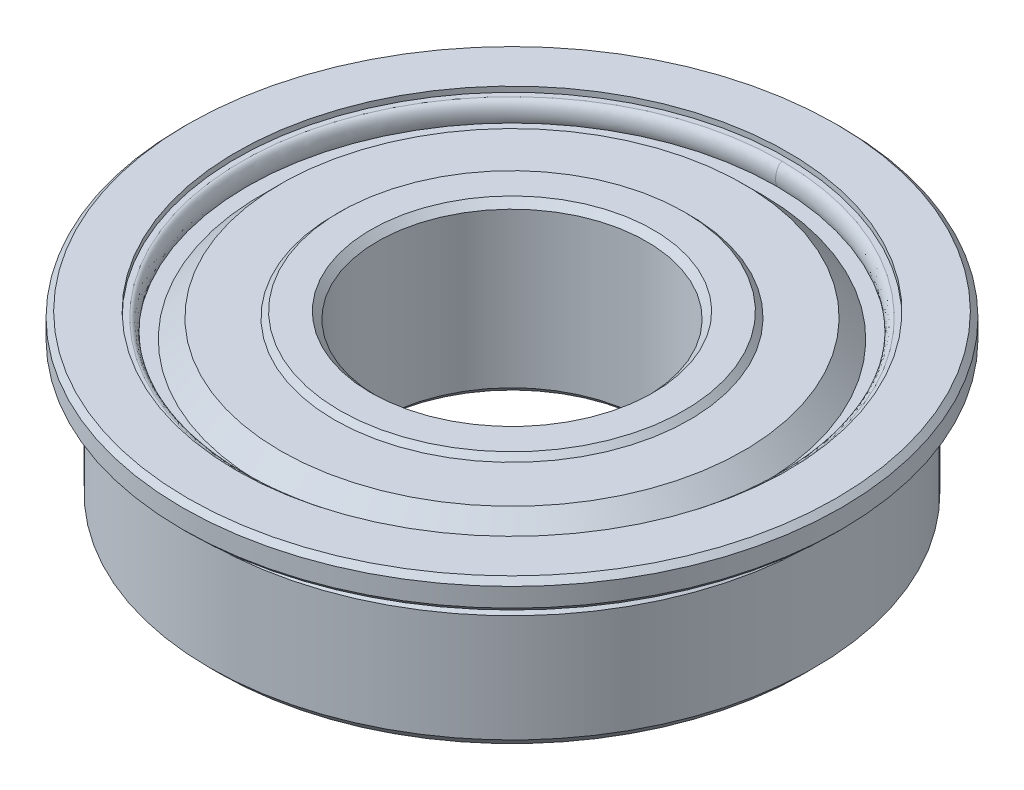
ISO-10303-21;
HEADER;
FILE_DESCRIPTION(('STEP AP214'),'2;1');
FILE_NAME('part.step','',(''),(''),'','','');
FILE_SCHEMA(('AUTOMOTIVE_DESIGN { 1 0 10303 214 1 1 1 1 }'));
ENDSEC;
DATA;
#1=APPLICATION_CONTEXT('core data for automotive mechanical design processes');
#2=APPLICATION_PROTOCOL_DEFINITION('international standard','automotive_design',2000,#1);
#3=PRODUCT_CONTEXT('',#1,'mechanical');
#4=PRODUCT('Part','Part','',(#3));
#5=PRODUCT_RELATED_PRODUCT_CATEGORY('part','',(#4));
#6=PRODUCT_DEFINITION_FORMATION('','',#4);
#7=PRODUCT_DEFINITION_CONTEXT('part definition',#1,'design');
#8=PRODUCT_DEFINITION('design','',#6,#7);
#9=PRODUCT_DEFINITION_SHAPE('','',#8);
#10=(LENGTH_UNIT() NAMED_UNIT(*) SI_UNIT(.MILLI.,.METRE.));
#11=(NAMED_UNIT(*) PLANE_ANGLE_UNIT() SI_UNIT($,.RADIAN.));
#12=(NAMED_UNIT(*) SI_UNIT($,.STERADIAN.) SOLID_ANGLE_UNIT());
#13=UNCERTAINTY_MEASURE_WITH_UNIT(LENGTH_MEASURE(1.E-05),#10,'distance_accuracy_value','');
#14=(GEOMETRIC_REPRESENTATION_CONTEXT(3) GLOBAL_UNCERTAINTY_ASSIGNED_CONTEXT((#13)) GLOBAL_UNIT_ASSIGNED_CONTEXT((#10,
#11,#12)) REPRESENTATION_CONTEXT('',''));
#15=CARTESIAN_POINT('',(0.,0.,0.));
#16=DIRECTION('',(0.,0.,1.));
#17=DIRECTION('',(1.,0.,0.));
#18=AXIS2_PLACEMENT_3D('',#15,#16,#17);
#19=CARTESIAN_POINT('',(0.,-0.254,-12.7635));
#20=CARTESIAN_POINT('',(-25.527,-0.253999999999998,-12.7635));
#21=CARTESIAN_POINT('',(-25.527,-0.254000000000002,12.7635));
#22=CARTESIAN_POINT('',(0.,-0.254,12.7635));
#23=CARTESIAN_POINT('',(0.,-0.254,-12.7168318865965));
#24=CARTESIAN_POINT('',(-25.433663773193,-0.253999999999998,-12.7168318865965));
#25=CARTESIAN_POINT('',(-25.433663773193,-0.254000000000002,12.7168318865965));
#26=CARTESIAN_POINT('',(0.,-0.254,12.7168318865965));
#27=CARTESIAN_POINT('',(0.,-0.291495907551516,-12.6089230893));
#28=CARTESIAN_POINT('',(-25.2178461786,-0.291495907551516,-12.6089230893));
#29=CARTESIAN_POINT('',(-25.2178461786,-0.291495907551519,12.6089230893));
#30=CARTESIAN_POINT('',(0.,-0.291495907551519,12.6089230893));
#31=CARTESIAN_POINT('',(0.,-0.538559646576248,-12.4652687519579));
#32=CARTESIAN_POINT('',(-24.9305375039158,-0.538559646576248,-12.4652687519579));
#33=CARTESIAN_POINT('',(-24.9305375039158,-0.538559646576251,12.4652687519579));
#34=CARTESIAN_POINT('',(0.,-0.538559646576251,12.4652687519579));
#35=CARTESIAN_POINT('',(0.,-0.890819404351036,-12.4309498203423));
#36=CARTESIAN_POINT('',(-24.8618996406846,-0.890819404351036,-12.4309498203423));
#37=CARTESIAN_POINT('',(-24.8618996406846,-0.890819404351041,12.4309498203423));
#38=CARTESIAN_POINT('',(0.,-0.890819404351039,12.4309498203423));
#39=CARTESIAN_POINT('',(0.,-1.07315356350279,-12.473578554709));
#40=CARTESIAN_POINT('',(-24.947157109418,-1.07315356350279,-12.473578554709));
#41=CARTESIAN_POINT('',(-24.947157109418,-1.0731535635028,12.473578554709));
#42=CARTESIAN_POINT('',(0.,-1.0731535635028,12.473578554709));
#43=CARTESIAN_POINT('',(0.,-1.143,-12.4995052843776));
#44=CARTESIAN_POINT('',(-24.9990105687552,-1.143,-12.4995052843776));
#45=CARTESIAN_POINT('',(-24.9990105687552,-1.143,12.4995052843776));
#46=CARTESIAN_POINT('',(0.,-1.143,12.4995052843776));
#47=(BOUNDED_SURFACE() B_SPLINE_SURFACE(3,3,((#19,#20,#21,#22),(#23,#24,#25,#26),(#27,#28,#29,
#30),(#31,#32,#33,#34),(#35,#36,#37,#38),(#39,#40,#41,#42),(#43,#44,#45,#46)),.UNSPECIFIED.,.F.,
.F.,.F.) B_SPLINE_SURFACE_WITH_KNOTS((4,1,1,1,4),(4,4),(0.,0.25,0.5,0.75,1.),(0.,1.),
.UNSPECIFIED.) GEOMETRIC_REPRESENTATION_ITEM() RATIONAL_B_SPLINE_SURFACE(((1.,0.333333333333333,
0.333333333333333,1.),(1.,0.333333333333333,0.333333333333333,1.),(1.,0.333333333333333,
0.333333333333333,1.),(1.,0.333333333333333,0.333333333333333,1.),(1.,0.333333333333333,
0.333333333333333,1.),(1.,0.333333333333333,0.333333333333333,1.),(1.,0.333333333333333,
0.333333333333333,1.))) REPRESENTATION_ITEM('') SURFACE());
#48=CARTESIAN_POINT('',(0.,-0.254,0.));
#49=DIRECTION('',(0.,1.,0.));
#50=DIRECTION('',(0.,0.,1.));
#51=AXIS2_PLACEMENT_3D('',#48,#49,#50);
#52=CIRCLE('',#51,12.7635);
#53=CARTESIAN_POINT('',(0.,-0.254,-12.7635));
#54=VERTEX_POINT('',#53);
#55=CARTESIAN_POINT('',(0.,-0.254,12.7635));
#56=VERTEX_POINT('',#55);
#57=EDGE_CURVE('E367',#54,#56,#52,.T.);
#58=CARTESIAN_POINT('',(0.,-0.254,12.7635));
#59=CARTESIAN_POINT('',(0.,-0.254,12.7168318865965));
#60=CARTESIAN_POINT('',(0.,-0.291495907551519,12.6089230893));
#61=CARTESIAN_POINT('',(0.,-0.538559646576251,12.4652687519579));
#62=CARTESIAN_POINT('',(0.,-0.890819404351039,12.4309498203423));
#63=CARTESIAN_POINT('',(0.,-1.0731535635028,12.473578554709));
#64=CARTESIAN_POINT('',(0.,-1.143,12.4995052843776));
#65=(BOUNDED_CURVE() B_SPLINE_CURVE(3,(#58,#59,#60,#61,#62,#63,#64),.UNSPECIFIED.,.F.,
.F.) B_SPLINE_CURVE_WITH_KNOTS((4,1,1,1,4),(0.,0.25,0.5,0.75,1.),
.UNSPECIFIED.) CURVE() GEOMETRIC_REPRESENTATION_ITEM() RATIONAL_B_SPLINE_CURVE((1.,1.,1.,1.,1.,
1.,1.)) REPRESENTATION_ITEM(''));
#66=CARTESIAN_POINT('',(0.,-1.143,12.4995052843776));
#67=VERTEX_POINT('',#66);
#68=EDGE_CURVE('E360',#56,#67,#65,.T.);
#69=CARTESIAN_POINT('',(0.,-1.143,0.));
#70=DIRECTION('',(0.,1.,0.));
#71=DIRECTION('',(0.,0.,1.));
#72=AXIS2_PLACEMENT_3D('',#69,#70,#71);
#73=CIRCLE('',#72,12.4995052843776);
#74=CARTESIAN_POINT('',(0.,-1.143,-12.4995052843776));
#75=VERTEX_POINT('',#74);
#76=EDGE_CURVE('E732',#75,#67,#73,.T.);
#77=CARTESIAN_POINT('',(0.,-0.254,-12.7635));
#78=CARTESIAN_POINT('',(0.,-0.254,-12.7168318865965));
#79=CARTESIAN_POINT('',(0.,-0.291495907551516,-12.6089230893));
#80=CARTESIAN_POINT('',(0.,-0.538559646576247,-12.4652687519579));
#81=CARTESIAN_POINT('',(0.,-0.890819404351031,-12.4309498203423));
#82=CARTESIAN_POINT('',(0.,-1.07315356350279,-12.473578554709));
#83=CARTESIAN_POINT('',(0.,-1.143,-12.4995052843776));
#84=(BOUNDED_CURVE() B_SPLINE_CURVE(3,(#77,#78,#79,#80,#81,#82,#83),.UNSPECIFIED.,.F.,
.F.) B_SPLINE_CURVE_WITH_KNOTS((4,1,1,1,4),(0.,0.25,0.5,0.75,1.),
.UNSPECIFIED.) CURVE() GEOMETRIC_REPRESENTATION_ITEM() RATIONAL_B_SPLINE_CURVE((1.,1.,1.,1.,1.,
1.,1.)) REPRESENTATION_ITEM(''));
#85=EDGE_CURVE('E151',#54,#75,#84,.T.);
#86=ORIENTED_EDGE('',*,*,#57,.T.);
#87=ORIENTED_EDGE('',*,*,#68,.T.);
#88=ORIENTED_EDGE('',*,*,#76,.F.);
#89=ORIENTED_EDGE('',*,*,#85,.F.);
#90=EDGE_LOOP('',(#86,#87,#88,#89));
#91=FACE_BOUND('',#90,.T.);
#92=ADVANCED_FACE('F17',(#91),#47,.F.);
#93=CARTESIAN_POINT('',(0.,-7.6835,12.7635));
#94=CARTESIAN_POINT('',(25.527,-7.6835,12.7635));
#95=CARTESIAN_POINT('',(25.527,-7.6835,-12.7635));
#96=CARTESIAN_POINT('',(0.,-7.6835,-12.7635));
#97=CARTESIAN_POINT('',(0.,-7.6835,12.7168318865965));
#98=CARTESIAN_POINT('',(25.433663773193,-7.6835,12.7168318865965));
#99=CARTESIAN_POINT('',(25.433663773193,-7.6835,-12.7168318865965));
#100=CARTESIAN_POINT('',(0.,-7.6835,-12.7168318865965));
#101=CARTESIAN_POINT('',(0.,-7.64600409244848,12.6089230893));
#102=CARTESIAN_POINT('',(25.2178461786,-7.64600409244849,12.6089230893));
#103=CARTESIAN_POINT('',(25.2178461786,-7.64600409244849,-12.6089230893));
#104=CARTESIAN_POINT('',(0.,-7.64600409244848,-12.6089230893));
#105=CARTESIAN_POINT('',(0.,-7.39894035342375,12.4652687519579));
#106=CARTESIAN_POINT('',(24.9305375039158,-7.39894035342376,12.4652687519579));
#107=CARTESIAN_POINT('',(24.9305375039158,-7.39894035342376,-12.4652687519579));
#108=CARTESIAN_POINT('',(0.,-7.39894035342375,-12.4652687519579));
#109=CARTESIAN_POINT('',(0.,-7.04668059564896,12.4309498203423));
#110=CARTESIAN_POINT('',(24.8618996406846,-7.04668059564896,12.4309498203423));
#111=CARTESIAN_POINT('',(24.8618996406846,-7.04668059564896,-12.4309498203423));
#112=CARTESIAN_POINT('',(0.,-7.04668059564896,-12.4309498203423));
#113=CARTESIAN_POINT('',(0.,-6.8643464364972,12.473578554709));
#114=CARTESIAN_POINT('',(24.947157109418,-6.86434643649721,12.473578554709));
#115=CARTESIAN_POINT('',(24.947157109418,-6.86434643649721,-12.473578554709));
#116=CARTESIAN_POINT('',(0.,-6.8643464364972,-12.473578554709));
#117=CARTESIAN_POINT('',(0.,-6.7945,12.4995052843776));
#118=CARTESIAN_POINT('',(24.9990105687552,-6.7945,12.4995052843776));
#119=CARTESIAN_POINT('',(24.9990105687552,-6.7945,-12.4995052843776));
#120=CARTESIAN_POINT('',(0.,-6.7945,-12.4995052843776));
#121=(BOUNDED_SURFACE() B_SPLINE_SURFACE(3,3,((#93,#94,#95,#96),(#97,#98,#99,#100),(#101,#102,
#103,#104),(#105,#106,#107,#108),(#109,#110,#111,#112),(#113,#114,#115,#116),(#117,#118,#119,
#120)),.UNSPECIFIED.,.F.,.F.,.F.) B_SPLINE_SURFACE_WITH_KNOTS((4,1,1,1,4),(4,4),(0.,0.25,0.5,
0.75,1.),(0.,1.),.UNSPECIFIED.) GEOMETRIC_REPRESENTATION_ITEM() RATIONAL_B_SPLINE_SURFACE(((1.,
0.333333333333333,0.333333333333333,1.),(1.,0.333333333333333,0.333333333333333,1.),(1.,
0.333333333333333,0.333333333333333,1.),(1.,0.333333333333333,0.333333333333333,1.),(1.,
0.333333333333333,0.333333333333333,1.),(1.,0.333333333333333,0.333333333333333,1.),(1.,
0.333333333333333,0.333333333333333,1.))) REPRESENTATION_ITEM('') SURFACE());
#122=CARTESIAN_POINT('',(0.,-7.6835,0.));
#123=DIRECTION('',(0.,1.,0.));
#124=DIRECTION('',(0.,0.,1.));
#125=AXIS2_PLACEMENT_3D('',#122,#123,#124);
#126=CIRCLE('',#125,12.7635);
#127=CARTESIAN_POINT('',(0.,-7.6835,12.7635));
#128=VERTEX_POINT('',#127);
#129=CARTESIAN_POINT('',(0.,-7.6835,-12.7635));
#130=VERTEX_POINT('',#129);
#131=EDGE_CURVE('E283',#128,#130,#126,.T.);
#132=CARTESIAN_POINT('',(0.,-7.6835,12.7635));
#133=CARTESIAN_POINT('',(0.,-7.6835,12.7168318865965));
#134=CARTESIAN_POINT('',(0.,-7.64600409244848,12.6089230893));
#135=CARTESIAN_POINT('',(0.,-7.39894035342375,12.4652687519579));
#136=CARTESIAN_POINT('',(0.,-7.04668059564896,12.4309498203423));
#137=CARTESIAN_POINT('',(0.,-6.8643464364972,12.473578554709));
#138=CARTESIAN_POINT('',(0.,-6.7945,12.4995052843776));
#139=(BOUNDED_CURVE() B_SPLINE_CURVE(3,(#132,#133,#134,#135,#136,#137,#138),.UNSPECIFIED.,.F.,
.F.) B_SPLINE_CURVE_WITH_KNOTS((4,1,1,1,4),(0.,0.25,0.5,0.75,1.),
.UNSPECIFIED.) CURVE() GEOMETRIC_REPRESENTATION_ITEM() RATIONAL_B_SPLINE_CURVE((0.999999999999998,
0.999999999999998,0.999999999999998,0.999999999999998,0.999999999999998,0.999999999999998,0.999999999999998)) REPRESENTATION_ITEM(''));
#140=CARTESIAN_POINT('',(0.,-6.7945,12.4995052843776));
#141=VERTEX_POINT('',#140);
#142=EDGE_CURVE('E264',#128,#141,#139,.T.);
#143=CARTESIAN_POINT('',(0.,-6.7945,0.));
#144=DIRECTION('',(0.,1.,0.));
#145=DIRECTION('',(0.,0.,1.));
#146=AXIS2_PLACEMENT_3D('',#143,#144,#145);
#147=CIRCLE('',#146,12.4995052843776);
#148=CARTESIAN_POINT('',(0.,-6.7945,-12.4995052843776));
#149=VERTEX_POINT('',#148);
#150=EDGE_CURVE('E271',#141,#149,#147,.T.);
#151=CARTESIAN_POINT('',(0.,-7.6835,-12.7635));
#152=CARTESIAN_POINT('',(0.,-7.6835,-12.7168318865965));
#153=CARTESIAN_POINT('',(0.,-7.64600409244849,-12.6089230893));
#154=CARTESIAN_POINT('',(0.,-7.39894035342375,-12.4652687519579));
#155=CARTESIAN_POINT('',(0.,-7.04668059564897,-12.4309498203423));
#156=CARTESIAN_POINT('',(0.,-6.8643464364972,-12.473578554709));
#157=CARTESIAN_POINT('',(0.,-6.7945,-12.4995052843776));
#158=(BOUNDED_CURVE() B_SPLINE_CURVE(3,(#151,#152,#153,#154,#155,#156,#157),.UNSPECIFIED.,.F.,
.F.) B_SPLINE_CURVE_WITH_KNOTS((4,1,1,1,4),(0.,0.25,0.5,0.75,1.),
.UNSPECIFIED.) CURVE() GEOMETRIC_REPRESENTATION_ITEM() RATIONAL_B_SPLINE_CURVE((0.999999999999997,
0.999999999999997,0.999999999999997,0.999999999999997,0.999999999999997,0.999999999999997,0.999999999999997)) REPRESENTATION_ITEM(''));
#159=EDGE_CURVE('E101',#130,#149,#158,.T.);
#160=ORIENTED_EDGE('',*,*,#131,.F.);
#161=ORIENTED_EDGE('',*,*,#142,.T.);
#162=ORIENTED_EDGE('',*,*,#150,.T.);
#163=ORIENTED_EDGE('',*,*,#159,.F.);
#164=EDGE_LOOP('',(#160,#161,#162,#163));
#165=FACE_BOUND('',#164,.T.);
#166=ADVANCED_FACE('F236',(#165),#121,.T.);
#167=CARTESIAN_POINT('',(0.,-1.524,0.));
#168=DIRECTION('',(0.,-1.,0.));
#169=DIRECTION('',(0.,0.,-1.));
#170=AXIS2_PLACEMENT_3D('',#167,#168,#169);
#171=TOROIDAL_SURFACE('',#170,14.224,0.127);
#172=CARTESIAN_POINT('',(0.,-1.524,0.));
#173=DIRECTION('',(0.,-1.,0.));
#174=DIRECTION('',(0.,0.,-1.));
#175=AXIS2_PLACEMENT_3D('',#172,#173,#174);
#176=CIRCLE('',#175,14.097);
#177=CARTESIAN_POINT('',(0.,-1.524,-14.097));
#178=VERTEX_POINT('',#177);
#179=EDGE_CURVE('E91',#178,#178,#176,.T.);
#180=ORIENTED_EDGE('',*,*,#179,.F.);
#181=EDGE_LOOP('',(#180));
#182=FACE_BOUND('',#181,.T.);
#183=CARTESIAN_POINT('',(0.,-1.397,0.));
#184=DIRECTION('',(0.,1.,0.));
#185=DIRECTION('',(0.,0.,-1.));
#186=AXIS2_PLACEMENT_3D('',#183,#184,#185);
#187=CIRCLE('',#186,14.224);
#188=CARTESIAN_POINT('',(0.,-1.397,-14.224));
#189=VERTEX_POINT('',#188);
#190=EDGE_CURVE('E316',#189,#189,#187,.T.);
#191=ORIENTED_EDGE('',*,*,#190,.F.);
#192=EDGE_LOOP('',(#191));
#193=FACE_BOUND('',#192,.T.);
#194=ADVANCED_FACE('F203',(#182,#193),#171,.F.);
#195=CARTESIAN_POINT('',(0.,-6.7945,0.));
#196=DIRECTION('',(0.,1.,0.));
#197=DIRECTION('',(0.,0.,1.));
#198=AXIS2_PLACEMENT_3D('',#195,#196,#197);
#199=CONICAL_SURFACE('',#198,11.811,0.78539816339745);
#200=CARTESIAN_POINT('',(0.,-7.6835,0.));
#201=DIRECTION('',(0.,1.,0.));
#202=DIRECTION('',(0.,0.,1.));
#203=AXIS2_PLACEMENT_3D('',#200,#201,#202);
#204=CIRCLE('',#203,10.922);
#205=CARTESIAN_POINT('',(0.,-7.6835,10.922));
#206=VERTEX_POINT('',#205);
#207=EDGE_CURVE('E728',#206,#206,#204,.T.);
#208=ORIENTED_EDGE('',*,*,#207,.T.);
#209=EDGE_LOOP('',(#208));
#210=FACE_BOUND('',#209,.T.);
#211=CARTESIAN_POINT('',(0.,-6.7945,0.));
#212=DIRECTION('',(0.,1.,0.));
#213=DIRECTION('',(0.,0.,1.));
#214=AXIS2_PLACEMENT_3D('',#211,#212,#213);
#215=CIRCLE('',#214,11.811);
#216=CARTESIAN_POINT('',(0.,-6.7945,11.811));
#217=VERTEX_POINT('',#216);
#218=EDGE_CURVE('E276',#217,#217,#215,.T.);
#219=ORIENTED_EDGE('',*,*,#218,.F.);
#220=EDGE_LOOP('',(#219));
#221=FACE_BOUND('',#220,.T.);
#222=ADVANCED_FACE('F199',(#210,#221),#199,.T.);
#223=CARTESIAN_POINT('',(0.,-7.6835,0.));
#224=DIRECTION('',(0.,1.,0.));
#225=DIRECTION('',(0.,0.,1.));
#226=AXIS2_PLACEMENT_3D('',#223,#224,#225);
#227=CONICAL_SURFACE('',#226,8.382,0.785398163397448);
#228=CARTESIAN_POINT('',(0.,-7.9375,0.));
#229=DIRECTION('',(0.,1.,0.));
#230=DIRECTION('',(0.,0.,1.));
#231=AXIS2_PLACEMENT_3D('',#228,#229,#230);
#232=CIRCLE('',#231,8.128);
#233=CARTESIAN_POINT('',(0.,-7.9375,8.128));
#234=VERTEX_POINT('',#233);
#235=EDGE_CURVE('E343',#234,#234,#232,.T.);
#236=ORIENTED_EDGE('',*,*,#235,.T.);
#237=EDGE_LOOP('',(#236));
#238=FACE_BOUND('',#237,.T.);
#239=CARTESIAN_POINT('',(0.,-7.6835,0.));
#240=DIRECTION('',(0.,1.,0.));
#241=DIRECTION('',(0.,0.,1.));
#242=AXIS2_PLACEMENT_3D('',#239,#240,#241);
#243=CIRCLE('',#242,8.382);
#244=CARTESIAN_POINT('',(0.,-7.6835,8.382));
#245=VERTEX_POINT('',#244);
#246=EDGE_CURVE('E725',#245,#245,#243,.T.);
#247=ORIENTED_EDGE('',*,*,#246,.F.);
#248=EDGE_LOOP('',(#247));
#249=FACE_BOUND('',#248,.T.);
#250=ADVANCED_FACE('F202',(#238,#249),#227,.T.);
#251=CARTESIAN_POINT('',(0.,-7.9375,0.));
#252=DIRECTION('',(0.,-1.,0.));
#253=DIRECTION('',(0.,0.,-1.));
#254=AXIS2_PLACEMENT_3D('',#251,#252,#253);
#255=CONICAL_SURFACE('',#254,6.6675,0.785398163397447);
#256=CARTESIAN_POINT('',(0.,-7.62,0.));
#257=DIRECTION('',(0.,1.,0.));
#258=DIRECTION('',(0.,0.,1.));
#259=AXIS2_PLACEMENT_3D('',#256,#257,#258);
#260=CIRCLE('',#259,6.35);
#261=CARTESIAN_POINT('',(0.,-7.62,6.35));
#262=VERTEX_POINT('',#261);
#263=EDGE_CURVE('E11',#262,#262,#260,.T.);
#264=ORIENTED_EDGE('',*,*,#263,.T.);
#265=EDGE_LOOP('',(#264));
#266=FACE_BOUND('',#265,.T.);
#267=CARTESIAN_POINT('',(0.,-7.9375,0.));
#268=DIRECTION('',(0.,1.,0.));
#269=DIRECTION('',(0.,0.,1.));
#270=AXIS2_PLACEMENT_3D('',#267,#268,#269);
#271=CIRCLE('',#270,6.6675);
#272=CARTESIAN_POINT('',(0.,-7.9375,6.6675));
#273=VERTEX_POINT('',#272);
#274=EDGE_CURVE('E348',#273,#273,#271,.T.);
#275=ORIENTED_EDGE('',*,*,#274,.F.);
#276=EDGE_LOOP('',(#275));
#277=FACE_BOUND('',#276,.T.);
#278=ADVANCED_FACE('F231',(#266,#277),#255,.F.);
#279=CARTESIAN_POINT('',(0.,0.,0.));
#280=DIRECTION('',(0.,1.,0.));
#281=DIRECTION('',(0.,0.,1.));
#282=AXIS2_PLACEMENT_3D('',#279,#280,#281);
#283=CYLINDRICAL_SURFACE('',#282,6.35);
#284=ORIENTED_EDGE('',*,*,#263,.F.);
#285=EDGE_LOOP('',(#284));
#286=FACE_BOUND('',#285,.T.);
#287=CARTESIAN_POINT('',(0.,-0.3175,0.));
#288=DIRECTION('',(0.,1.,0.));
#289=DIRECTION('',(0.,0.,1.));
#290=AXIS2_PLACEMENT_3D('',#287,#288,#289);
#291=CIRCLE('',#290,6.35);
#292=CARTESIAN_POINT('',(0.,-0.3175,6.35));
#293=VERTEX_POINT('',#292);
#294=EDGE_CURVE('E32',#293,#293,#291,.T.);
#295=ORIENTED_EDGE('',*,*,#294,.T.);
#296=EDGE_LOOP('',(#295));
#297=FACE_BOUND('',#296,.T.);
#298=ADVANCED_FACE('F227',(#286,#297),#283,.F.);
#299=CARTESIAN_POINT('',(0.,-0.3175,0.));
#300=DIRECTION('',(0.,1.,0.));
#301=DIRECTION('',(0.,0.,1.));
#302=AXIS2_PLACEMENT_3D('',#299,#300,#301);
#303=CONICAL_SURFACE('',#302,6.35,0.785398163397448);
#304=ORIENTED_EDGE('',*,*,#294,.F.);
#305=EDGE_LOOP('',(#304));
#306=FACE_BOUND('',#305,.T.);
#307=CARTESIAN_POINT('',(0.,0.,0.));
#308=DIRECTION('',(0.,1.,0.));
#309=DIRECTION('',(0.,0.,1.));
#310=AXIS2_PLACEMENT_3D('',#307,#308,#309);
#311=CIRCLE('',#310,6.6675);
#312=CARTESIAN_POINT('',(0.,0.,6.6675));
#313=VERTEX_POINT('',#312);
#314=EDGE_CURVE('E347',#313,#313,#311,.T.);
#315=ORIENTED_EDGE('',*,*,#314,.T.);
#316=EDGE_LOOP('',(#315));
#317=FACE_BOUND('',#316,.T.);
#318=ADVANCED_FACE('F224',(#306,#317),#303,.F.);
#319=CARTESIAN_POINT('',(0.,-0.254,0.));
#320=DIRECTION('',(0.,-1.,0.));
#321=DIRECTION('',(0.,0.,-1.));
#322=AXIS2_PLACEMENT_3D('',#319,#320,#321);
#323=CONICAL_SURFACE('',#322,8.382,0.785398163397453);
#324=CARTESIAN_POINT('',(0.,0.,0.));
#325=DIRECTION('',(0.,1.,0.));
#326=DIRECTION('',(0.,0.,1.));
#327=AXIS2_PLACEMENT_3D('',#324,#325,#326);
#328=CIRCLE('',#327,8.128);
#329=CARTESIAN_POINT('',(0.,0.,8.128));
#330=VERTEX_POINT('',#329);
#331=EDGE_CURVE('E338',#330,#330,#328,.T.);
#332=ORIENTED_EDGE('',*,*,#331,.F.);
#333=EDGE_LOOP('',(#332));
#334=FACE_BOUND('',#333,.T.);
#335=CARTESIAN_POINT('',(0.,-0.254,0.));
#336=DIRECTION('',(0.,1.,0.));
#337=DIRECTION('',(0.,0.,1.));
#338=AXIS2_PLACEMENT_3D('',#335,#336,#337);
#339=CIRCLE('',#338,8.382);
#340=CARTESIAN_POINT('',(0.,-0.254,8.382));
#341=VERTEX_POINT('',#340);
#342=EDGE_CURVE('E355',#341,#341,#339,.T.);
#343=ORIENTED_EDGE('',*,*,#342,.T.);
#344=EDGE_LOOP('',(#343));
#345=FACE_BOUND('',#344,.T.);
#346=ADVANCED_FACE('F222',(#334,#345),#323,.T.);
#347=CARTESIAN_POINT('',(0.,-1.143,0.));
#348=DIRECTION('',(0.,-1.,0.));
#349=DIRECTION('',(0.,0.,-1.));
#350=AXIS2_PLACEMENT_3D('',#347,#348,#349);
#351=CONICAL_SURFACE('',#350,11.811,0.785398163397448);
#352=CARTESIAN_POINT('',(0.,-0.254,0.));
#353=DIRECTION('',(0.,1.,0.));
#354=DIRECTION('',(0.,0.,1.));
#355=AXIS2_PLACEMENT_3D('',#352,#353,#354);
#356=CIRCLE('',#355,10.922);
#357=CARTESIAN_POINT('',(0.,-0.254,10.922));
#358=VERTEX_POINT('',#357);
#359=EDGE_CURVE('E352',#358,#358,#356,.T.);
#360=ORIENTED_EDGE('',*,*,#359,.F.);
#361=EDGE_LOOP('',(#360));
#362=FACE_BOUND('',#361,.T.);
#363=CARTESIAN_POINT('',(0.,-1.143,0.));
#364=DIRECTION('',(0.,1.,0.));
#365=DIRECTION('',(0.,0.,1.));
#366=AXIS2_PLACEMENT_3D('',#363,#364,#365);
#367=CIRCLE('',#366,11.811);
#368=CARTESIAN_POINT('',(0.,-1.143,11.811));
#369=VERTEX_POINT('',#368);
#370=EDGE_CURVE('E357',#369,#369,#367,.T.);
#371=ORIENTED_EDGE('',*,*,#370,.T.);
#372=EDGE_LOOP('',(#371));
#373=FACE_BOUND('',#372,.T.);
#374=ADVANCED_FACE('F218',(#362,#373),#351,.T.);
#375=CARTESIAN_POINT('',(0.,0.,0.));
#376=DIRECTION('',(0.,1.,0.));
#377=DIRECTION('',(0.,0.,1.));
#378=AXIS2_PLACEMENT_3D('',#375,#376,#377);
#379=CYLINDRICAL_SURFACE('',#378,13.0175);
#380=CARTESIAN_POINT('',(0.,-0.254,0.));
#381=DIRECTION('',(0.,1.,0.));
#382=DIRECTION('',(0.,0.,1.));
#383=AXIS2_PLACEMENT_3D('',#380,#381,#382);
#384=CIRCLE('',#383,13.0175);
#385=CARTESIAN_POINT('',(0.,-0.254,13.0175));
#386=VERTEX_POINT('',#385);
#387=EDGE_CURVE('E363',#386,#386,#384,.T.);
#388=ORIENTED_EDGE('',*,*,#387,.F.);
#389=EDGE_LOOP('',(#388));
#390=FACE_BOUND('',#389,.T.);
#391=CARTESIAN_POINT('',(0.,0.,0.));
#392=DIRECTION('',(0.,1.,0.));
#393=DIRECTION('',(0.,0.,1.));
#394=AXIS2_PLACEMENT_3D('',#391,#392,#393);
#395=CIRCLE('',#394,13.0175);
#396=CARTESIAN_POINT('',(0.,0.,13.0175));
#397=VERTEX_POINT('',#396);
#398=EDGE_CURVE('E342',#397,#397,#395,.T.);
#399=ORIENTED_EDGE('',*,*,#398,.T.);
#400=EDGE_LOOP('',(#399));
#401=FACE_BOUND('',#400,.T.);
#402=ADVANCED_FACE('F215',(#390,#401),#379,.F.);
#403=CARTESIAN_POINT('',(0.,0.,0.));
#404=DIRECTION('',(0.,-1.,0.));
#405=DIRECTION('',(0.,0.,-1.));
#406=AXIS2_PLACEMENT_3D('',#403,#404,#405);
#407=CONICAL_SURFACE('',#406,15.3035,0.785398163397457);
#408=CARTESIAN_POINT('',(0.,0.,0.));
#409=DIRECTION('',(0.,1.,0.));
#410=DIRECTION('',(0.,0.,1.));
#411=AXIS2_PLACEMENT_3D('',#408,#409,#410);
#412=CIRCLE('',#411,15.3035);
#413=CARTESIAN_POINT('',(0.,0.,15.3035));
#414=VERTEX_POINT('',#413);
#415=EDGE_CURVE('E334',#414,#414,#412,.T.);
#416=ORIENTED_EDGE('',*,*,#415,.F.);
#417=EDGE_LOOP('',(#416));
#418=FACE_BOUND('',#417,.T.);
#419=CARTESIAN_POINT('',(0.,-0.254,0.));
#420=DIRECTION('',(0.,1.,0.));
#421=DIRECTION('',(0.,0.,1.));
#422=AXIS2_PLACEMENT_3D('',#419,#420,#421);
#423=CIRCLE('',#422,15.5575);
#424=CARTESIAN_POINT('',(0.,-0.254,15.5575));
#425=VERTEX_POINT('',#424);
#426=EDGE_CURVE('E81',#425,#425,#423,.T.);
#427=ORIENTED_EDGE('',*,*,#426,.T.);
#428=EDGE_LOOP('',(#427));
#429=FACE_BOUND('',#428,.T.);
#430=ADVANCED_FACE('F82',(#418,#429),#407,.T.);
#431=CARTESIAN_POINT('',(0.,0.,0.));
#432=DIRECTION('',(0.,1.,0.));
#433=DIRECTION('',(0.,0.,1.));
#434=AXIS2_PLACEMENT_3D('',#431,#432,#433);
#435=CYLINDRICAL_SURFACE('',#434,15.5575);
#436=CARTESIAN_POINT('',(0.,-1.143,0.));
#437=DIRECTION('',(0.,1.,0.));
#438=DIRECTION('',(0.,0.,1.));
#439=AXIS2_PLACEMENT_3D('',#436,#437,#438);
#440=CIRCLE('',#439,15.5575);
#441=CARTESIAN_POINT('',(0.,-1.143,15.5575));
#442=VERTEX_POINT('',#441);
#443=EDGE_CURVE('E85',#442,#442,#440,.T.);
#444=ORIENTED_EDGE('',*,*,#443,.T.);
#445=EDGE_LOOP('',(#444));
#446=FACE_BOUND('',#445,.T.);
#447=ORIENTED_EDGE('',*,*,#426,.F.);
#448=EDGE_LOOP('',(#447));
#449=FACE_BOUND('',#448,.T.);
#450=ADVANCED_FACE('F568',(#446,#449),#435,.T.);
#451=CARTESIAN_POINT('',(0.,-1.397,0.));
#452=DIRECTION('',(0.,1.,0.));
#453=DIRECTION('',(0.,0.,1.));
#454=AXIS2_PLACEMENT_3D('',#451,#452,#453);
#455=CONICAL_SURFACE('',#454,15.3035,0.785398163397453);
#456=CARTESIAN_POINT('',(0.,-1.397,0.));
#457=DIRECTION('',(0.,1.,0.));
#458=DIRECTION('',(0.,0.,1.));
#459=AXIS2_PLACEMENT_3D('',#456,#457,#458);
#460=CIRCLE('',#459,15.3035);
#461=CARTESIAN_POINT('',(0.,-1.397,15.3035));
#462=VERTEX_POINT('',#461);
#463=EDGE_CURVE('E324',#462,#462,#460,.T.);
#464=ORIENTED_EDGE('',*,*,#463,.T.);
#465=EDGE_LOOP('',(#464));
#466=FACE_BOUND('',#465,.T.);
#467=ORIENTED_EDGE('',*,*,#443,.F.);
#468=EDGE_LOOP('',(#467));
#469=FACE_BOUND('',#468,.T.);
#470=ADVANCED_FACE('F122',(#466,#469),#455,.T.);
#471=CARTESIAN_POINT('',(0.,0.,0.));
#472=DIRECTION('',(0.,1.,0.));
#473=DIRECTION('',(0.,0.,1.));
#474=AXIS2_PLACEMENT_3D('',#471,#472,#473);
#475=CYLINDRICAL_SURFACE('',#474,14.097);
#476=CARTESIAN_POINT('',(0.,-2.159,0.));
#477=DIRECTION('',(0.,1.,0.));
#478=DIRECTION('',(0.,0.,1.));
#479=AXIS2_PLACEMENT_3D('',#476,#477,#478);
#480=CIRCLE('',#479,14.097);
#481=CARTESIAN_POINT('',(0.,-2.159,14.097));
#482=VERTEX_POINT('',#481);
#483=EDGE_CURVE('E303',#482,#482,#480,.T.);
#484=ORIENTED_EDGE('',*,*,#483,.T.);
#485=EDGE_LOOP('',(#484));
#486=FACE_BOUND('',#485,.T.);
#487=ORIENTED_EDGE('',*,*,#179,.T.);
#488=EDGE_LOOP('',(#487));
#489=FACE_BOUND('',#488,.T.);
#490=ADVANCED_FACE('F210',(#486,#489),#475,.T.);
#491=CARTESIAN_POINT('',(0.,-2.3495,0.));
#492=DIRECTION('',(0.,-1.,0.));
#493=DIRECTION('',(0.,0.,-1.));
#494=AXIS2_PLACEMENT_3D('',#491,#492,#493);
#495=CONICAL_SURFACE('',#494,14.2875,0.785398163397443);
#496=ORIENTED_EDGE('',*,*,#483,.F.);
#497=EDGE_LOOP('',(#496));
#498=FACE_BOUND('',#497,.T.);
#499=CARTESIAN_POINT('',(0.,-2.3495,0.));
#500=DIRECTION('',(0.,1.,0.));
#501=DIRECTION('',(0.,0.,1.));
#502=AXIS2_PLACEMENT_3D('',#499,#500,#501);
#503=CIRCLE('',#502,14.2875);
#504=CARTESIAN_POINT('',(0.,-2.3495,14.2875));
#505=VERTEX_POINT('',#504);
#506=EDGE_CURVE('E297',#505,#505,#503,.T.);
#507=ORIENTED_EDGE('',*,*,#506,.T.);
#508=EDGE_LOOP('',(#507));
#509=FACE_BOUND('',#508,.T.);
#510=ADVANCED_FACE('F197',(#498,#509),#495,.T.);
#511=CARTESIAN_POINT('',(0.,0.,0.));
#512=DIRECTION('',(0.,1.,0.));
#513=DIRECTION('',(0.,0.,1.));
#514=AXIS2_PLACEMENT_3D('',#511,#512,#513);
#515=CYLINDRICAL_SURFACE('',#514,14.2875);
#516=CARTESIAN_POINT('',(0.,-7.4295,0.));
#517=DIRECTION('',(0.,1.,0.));
#518=DIRECTION('',(0.,0.,1.));
#519=AXIS2_PLACEMENT_3D('',#516,#517,#518);
#520=CIRCLE('',#519,14.2875);
#521=CARTESIAN_POINT('',(0.,-7.4295,14.2875));
#522=VERTEX_POINT('',#521);
#523=EDGE_CURVE('E294',#522,#522,#520,.T.);
#524=ORIENTED_EDGE('',*,*,#523,.T.);
#525=EDGE_LOOP('',(#524));
#526=FACE_BOUND('',#525,.T.);
#527=ORIENTED_EDGE('',*,*,#506,.F.);
#528=EDGE_LOOP('',(#527));
#529=FACE_BOUND('',#528,.T.);
#530=ADVANCED_FACE('F194',(#526,#529),#515,.T.);
#531=CARTESIAN_POINT('',(0.,-7.4295,0.));
#532=DIRECTION('',(0.,1.,0.));
#533=DIRECTION('',(0.,0.,1.));
#534=AXIS2_PLACEMENT_3D('',#531,#532,#533);
#535=CONICAL_SURFACE('',#534,14.2875,0.785398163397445);
#536=CARTESIAN_POINT('',(0.,-7.9375,0.));
#537=DIRECTION('',(0.,1.,0.));
#538=DIRECTION('',(0.,0.,1.));
#539=AXIS2_PLACEMENT_3D('',#536,#537,#538);
#540=CIRCLE('',#539,13.7795);
#541=CARTESIAN_POINT('',(0.,-7.9375,13.7795));
#542=VERTEX_POINT('',#541);
#543=EDGE_CURVE('E323',#542,#542,#540,.T.);
#544=ORIENTED_EDGE('',*,*,#543,.T.);
#545=EDGE_LOOP('',(#544));
#546=FACE_BOUND('',#545,.T.);
#547=ORIENTED_EDGE('',*,*,#523,.F.);
#548=EDGE_LOOP('',(#547));
#549=FACE_BOUND('',#548,.T.);
#550=ADVANCED_FACE('F192',(#546,#549),#535,.T.);
#551=CARTESIAN_POINT('',(0.,0.,0.));
#552=DIRECTION('',(0.,1.,0.));
#553=DIRECTION('',(0.,0.,1.));
#554=AXIS2_PLACEMENT_3D('',#551,#552,#553);
#555=CYLINDRICAL_SURFACE('',#554,13.0175);
#556=CARTESIAN_POINT('',(0.,-7.9375,0.));
#557=DIRECTION('',(0.,1.,0.));
#558=DIRECTION('',(0.,0.,1.));
#559=AXIS2_PLACEMENT_3D('',#556,#557,#558);
#560=CIRCLE('',#559,13.0175);
#561=CARTESIAN_POINT('',(0.,-7.9375,13.0175));
#562=VERTEX_POINT('',#561);
#563=EDGE_CURVE('E331',#562,#562,#560,.T.);
#564=ORIENTED_EDGE('',*,*,#563,.F.);
#565=EDGE_LOOP('',(#564));
#566=FACE_BOUND('',#565,.T.);
#567=CARTESIAN_POINT('',(0.,-7.6835,0.));
#568=DIRECTION('',(0.,1.,0.));
#569=DIRECTION('',(0.,0.,1.));
#570=AXIS2_PLACEMENT_3D('',#567,#568,#569);
#571=CIRCLE('',#570,13.0175);
#572=CARTESIAN_POINT('',(0.,-7.6835,13.0175));
#573=VERTEX_POINT('',#572);
#574=EDGE_CURVE('E284',#573,#573,#571,.T.);
#575=ORIENTED_EDGE('',*,*,#574,.T.);
#576=EDGE_LOOP('',(#575));
#577=FACE_BOUND('',#576,.T.);
#578=ADVANCED_FACE('F121',(#566,#577),#555,.F.);
#579=CARTESIAN_POINT('',(0.,-7.6835,-12.7635));
#580=CARTESIAN_POINT('',(-25.527,-7.6835,-12.7635));
#581=CARTESIAN_POINT('',(-25.527,-7.6835,12.7635));
#582=CARTESIAN_POINT('',(0.,-7.6835,12.7635));
#583=CARTESIAN_POINT('',(0.,-7.6835,-12.7168318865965));
#584=CARTESIAN_POINT('',(-25.433663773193,-7.6835,-12.7168318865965));
#585=CARTESIAN_POINT('',(-25.433663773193,-7.6835,12.7168318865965));
#586=CARTESIAN_POINT('',(0.,-7.6835,12.7168318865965));
#587=CARTESIAN_POINT('',(0.,-7.64600409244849,-12.6089230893));
#588=CARTESIAN_POINT('',(-25.2178461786,-7.64600409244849,-12.6089230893));
#589=CARTESIAN_POINT('',(-25.2178461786,-7.64600409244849,12.6089230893));
#590=CARTESIAN_POINT('',(0.,-7.64600409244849,12.6089230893));
#591=CARTESIAN_POINT('',(0.,-7.39894035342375,-12.4652687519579));
#592=CARTESIAN_POINT('',(-24.9305375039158,-7.39894035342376,-12.4652687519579));
#593=CARTESIAN_POINT('',(-24.9305375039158,-7.39894035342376,12.4652687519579));
#594=CARTESIAN_POINT('',(0.,-7.39894035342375,12.4652687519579));
#595=CARTESIAN_POINT('',(0.,-7.04668059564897,-12.4309498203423));
#596=CARTESIAN_POINT('',(-24.8618996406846,-7.04668059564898,-12.4309498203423));
#597=CARTESIAN_POINT('',(-24.8618996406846,-7.04668059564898,12.4309498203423));
#598=CARTESIAN_POINT('',(0.,-7.04668059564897,12.4309498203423));
#599=CARTESIAN_POINT('',(0.,-6.8643464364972,-12.473578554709));
#600=CARTESIAN_POINT('',(-24.947157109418,-6.86434643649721,-12.473578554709));
#601=CARTESIAN_POINT('',(-24.947157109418,-6.86434643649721,12.473578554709));
#602=CARTESIAN_POINT('',(0.,-6.86434643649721,12.473578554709));
#603=CARTESIAN_POINT('',(0.,-6.7945,-12.4995052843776));
#604=CARTESIAN_POINT('',(-24.9990105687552,-6.7945,-12.4995052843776));
#605=CARTESIAN_POINT('',(-24.9990105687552,-6.7945,12.4995052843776));
#606=CARTESIAN_POINT('',(0.,-6.7945,12.4995052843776));
#607=(BOUNDED_SURFACE() B_SPLINE_SURFACE(3,3,((#579,#580,#581,#582),(#583,#584,#585,#586),(#587,
#588,#589,#590),(#591,#592,#593,#594),(#595,#596,#597,#598),(#599,#600,#601,#602),(#603,#604,
#605,#606)),.UNSPECIFIED.,.F.,.F.,.F.) B_SPLINE_SURFACE_WITH_KNOTS((4,1,1,1,4),(4,4),(0.,0.25,
0.5,0.75,1.),(0.,1.),
.UNSPECIFIED.) GEOMETRIC_REPRESENTATION_ITEM() RATIONAL_B_SPLINE_SURFACE(((1.,0.333333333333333,
0.333333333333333,1.),(1.,0.333333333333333,0.333333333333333,1.),(1.,0.333333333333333,
0.333333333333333,1.),(1.,0.333333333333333,0.333333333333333,1.),(1.,0.333333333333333,
0.333333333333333,1.),(1.,0.333333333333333,0.333333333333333,1.),(1.,0.333333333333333,
0.333333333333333,1.))) REPRESENTATION_ITEM('') SURFACE());
#608=CARTESIAN_POINT('',(0.,-7.6835,0.));
#609=DIRECTION('',(0.,1.,0.));
#610=DIRECTION('',(0.,0.,1.));
#611=AXIS2_PLACEMENT_3D('',#608,#609,#610);
#612=CIRCLE('',#611,12.7635);
#613=EDGE_CURVE('E279',#130,#128,#612,.T.);
#614=CARTESIAN_POINT('',(0.,-6.7945,0.));
#615=DIRECTION('',(0.,1.,0.));
#616=DIRECTION('',(0.,0.,1.));
#617=AXIS2_PLACEMENT_3D('',#614,#615,#616);
#618=CIRCLE('',#617,12.4995052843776);
#619=EDGE_CURVE('E268',#149,#141,#618,.T.);
#620=ORIENTED_EDGE('',*,*,#142,.F.);
#621=ORIENTED_EDGE('',*,*,#613,.F.);
#622=ORIENTED_EDGE('',*,*,#159,.T.);
#623=ORIENTED_EDGE('',*,*,#619,.T.);
#624=EDGE_LOOP('',(#620,#621,#622,#623));
#625=FACE_BOUND('',#624,.T.);
#626=ADVANCED_FACE('F108',(#625),#607,.T.);
#627=CARTESIAN_POINT('',(0.,-7.6835,0.));
#628=DIRECTION('',(0.,-1.,0.));
#629=DIRECTION('',(0.,0.,-1.));
#630=AXIS2_PLACEMENT_3D('',#627,#628,#629);
#631=PLANE('',#630);
#632=ORIENTED_EDGE('',*,*,#613,.T.);
#633=ORIENTED_EDGE('',*,*,#131,.T.);
#634=EDGE_LOOP('',(#632,#633));
#635=FACE_BOUND('',#634,.T.);
#636=ORIENTED_EDGE('',*,*,#574,.F.);
#637=EDGE_LOOP('',(#636));
#638=FACE_BOUND('',#637,.T.);
#639=ADVANCED_FACE('F120',(#635,#638),#631,.T.);
#640=CARTESIAN_POINT('',(0.,-7.9375,0.));
#641=DIRECTION('',(0.,-1.,0.));
#642=DIRECTION('',(0.,0.,-1.));
#643=AXIS2_PLACEMENT_3D('',#640,#641,#642);
#644=PLANE('',#643);
#645=ORIENTED_EDGE('',*,*,#563,.T.);
#646=EDGE_LOOP('',(#645));
#647=FACE_BOUND('',#646,.T.);
#648=ORIENTED_EDGE('',*,*,#543,.F.);
#649=EDGE_LOOP('',(#648));
#650=FACE_BOUND('',#649,.T.);
#651=ADVANCED_FACE('F180',(#647,#650),#644,.T.);
#652=CARTESIAN_POINT('',(0.,-1.397,0.));
#653=DIRECTION('',(0.,-1.,0.));
#654=DIRECTION('',(0.,0.,-1.));
#655=AXIS2_PLACEMENT_3D('',#652,#653,#654);
#656=PLANE('',#655);
#657=ORIENTED_EDGE('',*,*,#190,.T.);
#658=EDGE_LOOP('',(#657));
#659=FACE_BOUND('',#658,.T.);
#660=ORIENTED_EDGE('',*,*,#463,.F.);
#661=EDGE_LOOP('',(#660));
#662=FACE_BOUND('',#661,.T.);
#663=ADVANCED_FACE('F185',(#659,#662),#656,.T.);
#664=CARTESIAN_POINT('',(0.,0.,0.));
#665=DIRECTION('',(0.,1.,0.));
#666=DIRECTION('',(1.,0.,0.));
#667=AXIS2_PLACEMENT_3D('',#664,#665,#666);
#668=PLANE('',#667);
#669=ORIENTED_EDGE('',*,*,#415,.T.);
#670=EDGE_LOOP('',(#669));
#671=FACE_BOUND('',#670,.T.);
#672=ORIENTED_EDGE('',*,*,#398,.F.);
#673=EDGE_LOOP('',(#672));
#674=FACE_BOUND('',#673,.T.);
#675=ADVANCED_FACE('F182',(#671,#674),#668,.T.);
#676=CARTESIAN_POINT('',(0.,-0.254,0.));
#677=DIRECTION('',(0.,-1.,0.));
#678=DIRECTION('',(0.,0.,-1.));
#679=AXIS2_PLACEMENT_3D('',#676,#677,#678);
#680=PLANE('',#679);
#681=ORIENTED_EDGE('',*,*,#57,.F.);
#682=CARTESIAN_POINT('',(0.,-0.254,0.));
#683=DIRECTION('',(0.,1.,0.));
#684=DIRECTION('',(0.,0.,1.));
#685=AXIS2_PLACEMENT_3D('',#682,#683,#684);
#686=CIRCLE('',#685,12.7635);
#687=EDGE_CURVE('E719',#56,#54,#686,.T.);
#688=ORIENTED_EDGE('',*,*,#687,.F.);
#689=EDGE_LOOP('',(#681,#688));
#690=FACE_BOUND('',#689,.T.);
#691=ORIENTED_EDGE('',*,*,#387,.T.);
#692=EDGE_LOOP('',(#691));
#693=FACE_BOUND('',#692,.T.);
#694=ADVANCED_FACE('F170',(#690,#693),#680,.F.);
#695=CARTESIAN_POINT('',(0.,-0.254,12.7635));
#696=CARTESIAN_POINT('',(25.527,-0.254000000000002,12.7635));
#697=CARTESIAN_POINT('',(25.527,-0.253999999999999,-12.7635));
#698=CARTESIAN_POINT('',(0.,-0.254,-12.7635));
#699=CARTESIAN_POINT('',(0.,-0.254,12.7168318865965));
#700=CARTESIAN_POINT('',(25.433663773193,-0.254000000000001,12.7168318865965));
#701=CARTESIAN_POINT('',(25.433663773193,-0.253999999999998,-12.7168318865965));
#702=CARTESIAN_POINT('',(0.,-0.254,-12.7168318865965));
#703=CARTESIAN_POINT('',(0.,-0.291495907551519,12.6089230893));
#704=CARTESIAN_POINT('',(25.2178461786,-0.291495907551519,12.6089230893));
#705=CARTESIAN_POINT('',(25.2178461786,-0.291495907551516,-12.6089230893));
#706=CARTESIAN_POINT('',(0.,-0.291495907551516,-12.6089230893));
#707=CARTESIAN_POINT('',(0.,-0.53855964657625,12.4652687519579));
#708=CARTESIAN_POINT('',(24.9305375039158,-0.53855964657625,12.4652687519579));
#709=CARTESIAN_POINT('',(24.9305375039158,-0.538559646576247,-12.4652687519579));
#710=CARTESIAN_POINT('',(0.,-0.538559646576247,-12.4652687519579));
#711=CARTESIAN_POINT('',(0.,-0.890819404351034,12.4309498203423));
#712=CARTESIAN_POINT('',(24.8618996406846,-0.890819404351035,12.4309498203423));
#713=CARTESIAN_POINT('',(24.8618996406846,-0.890819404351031,-12.4309498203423));
#714=CARTESIAN_POINT('',(0.,-0.890819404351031,-12.4309498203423));
#715=CARTESIAN_POINT('',(0.,-1.0731535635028,12.473578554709));
#716=CARTESIAN_POINT('',(24.947157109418,-1.0731535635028,12.473578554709));
#717=CARTESIAN_POINT('',(24.947157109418,-1.07315356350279,-12.473578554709));
#718=CARTESIAN_POINT('',(0.,-1.07315356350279,-12.473578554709));
#719=CARTESIAN_POINT('',(0.,-1.143,12.4995052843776));
#720=CARTESIAN_POINT('',(24.9990105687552,-1.143,12.4995052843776));
#721=CARTESIAN_POINT('',(24.9990105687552,-1.143,-12.4995052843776));
#722=CARTESIAN_POINT('',(0.,-1.143,-12.4995052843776));
#723=(BOUNDED_SURFACE() B_SPLINE_SURFACE(3,3,((#695,#696,#697,#698),(#699,#700,#701,#702),(#703,
#704,#705,#706),(#707,#708,#709,#710),(#711,#712,#713,#714),(#715,#716,#717,#718),(#719,#720,
#721,#722)),.UNSPECIFIED.,.F.,.F.,.F.) B_SPLINE_SURFACE_WITH_KNOTS((4,1,1,1,4),(4,4),(0.,0.25,
0.5,0.75,1.),(0.,1.),
.UNSPECIFIED.) GEOMETRIC_REPRESENTATION_ITEM() RATIONAL_B_SPLINE_SURFACE(((1.,0.333333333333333,
0.333333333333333,1.),(1.,0.333333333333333,0.333333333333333,1.),(1.,0.333333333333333,
0.333333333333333,1.),(1.,0.333333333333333,0.333333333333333,1.),(1.,0.333333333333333,
0.333333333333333,1.),(1.,0.333333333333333,0.333333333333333,1.),(1.,0.333333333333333,
0.333333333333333,1.))) REPRESENTATION_ITEM('') SURFACE());
#724=CARTESIAN_POINT('',(0.,-1.143,0.));
#725=DIRECTION('',(0.,1.,0.));
#726=DIRECTION('',(0.,0.,1.));
#727=AXIS2_PLACEMENT_3D('',#724,#725,#726);
#728=CIRCLE('',#727,12.4995052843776);
#729=EDGE_CURVE('E361',#67,#75,#728,.T.);
#730=ORIENTED_EDGE('',*,*,#68,.F.);
#731=ORIENTED_EDGE('',*,*,#687,.T.);
#732=ORIENTED_EDGE('',*,*,#85,.T.);
#733=ORIENTED_EDGE('',*,*,#729,.F.);
#734=EDGE_LOOP('',(#730,#731,#732,#733));
#735=FACE_BOUND('',#734,.T.);
#736=ADVANCED_FACE('F157',(#735),#723,.F.);
#737=CARTESIAN_POINT('',(0.,-1.143,0.));
#738=DIRECTION('',(0.,-1.,0.));
#739=DIRECTION('',(0.,0.,-1.));
#740=AXIS2_PLACEMENT_3D('',#737,#738,#739);
#741=PLANE('',#740);
#742=ORIENTED_EDGE('',*,*,#370,.F.);
#743=EDGE_LOOP('',(#742));
#744=FACE_BOUND('',#743,.T.);
#745=ORIENTED_EDGE('',*,*,#76,.T.);
#746=ORIENTED_EDGE('',*,*,#729,.T.);
#747=EDGE_LOOP('',(#745,#746));
#748=FACE_BOUND('',#747,.T.);
#749=ADVANCED_FACE('F169',(#744,#748),#741,.F.);
#750=CARTESIAN_POINT('',(0.,-0.254,0.));
#751=DIRECTION('',(0.,-1.,0.));
#752=DIRECTION('',(0.,0.,-1.));
#753=AXIS2_PLACEMENT_3D('',#750,#751,#752);
#754=PLANE('',#753);
#755=ORIENTED_EDGE('',*,*,#342,.F.);
#756=EDGE_LOOP('',(#755));
#757=FACE_BOUND('',#756,.T.);
#758=ORIENTED_EDGE('',*,*,#359,.T.);
#759=EDGE_LOOP('',(#758));
#760=FACE_BOUND('',#759,.T.);
#761=ADVANCED_FACE('F557',(#757,#760),#754,.F.);
#762=CARTESIAN_POINT('',(0.,0.,0.));
#763=DIRECTION('',(0.,1.,0.));
#764=DIRECTION('',(1.,0.,0.));
#765=AXIS2_PLACEMENT_3D('',#762,#763,#764);
#766=PLANE('',#765);
#767=ORIENTED_EDGE('',*,*,#331,.T.);
#768=EDGE_LOOP('',(#767));
#769=FACE_BOUND('',#768,.T.);
#770=ORIENTED_EDGE('',*,*,#314,.F.);
#771=EDGE_LOOP('',(#770));
#772=FACE_BOUND('',#771,.T.);
#773=ADVANCED_FACE('F564',(#769,#772),#766,.T.);
#774=CARTESIAN_POINT('',(0.,-7.9375,0.));
#775=DIRECTION('',(0.,-1.,0.));
#776=DIRECTION('',(0.,0.,-1.));
#777=AXIS2_PLACEMENT_3D('',#774,#775,#776);
#778=PLANE('',#777);
#779=ORIENTED_EDGE('',*,*,#235,.F.);
#780=EDGE_LOOP('',(#779));
#781=FACE_BOUND('',#780,.T.);
#782=ORIENTED_EDGE('',*,*,#274,.T.);
#783=EDGE_LOOP('',(#782));
#784=FACE_BOUND('',#783,.T.);
#785=ADVANCED_FACE('F124',(#781,#784),#778,.T.);
#786=CARTESIAN_POINT('',(0.,-7.6835,0.));
#787=DIRECTION('',(0.,-1.,0.));
#788=DIRECTION('',(0.,0.,-1.));
#789=AXIS2_PLACEMENT_3D('',#786,#787,#788);
#790=PLANE('',#789);
#791=ORIENTED_EDGE('',*,*,#246,.T.);
#792=EDGE_LOOP('',(#791));
#793=FACE_BOUND('',#792,.T.);
#794=ORIENTED_EDGE('',*,*,#207,.F.);
#795=EDGE_LOOP('',(#794));
#796=FACE_BOUND('',#795,.T.);
#797=ADVANCED_FACE('F584',(#793,#796),#790,.T.);
#798=CARTESIAN_POINT('',(0.,-6.7945,0.));
#799=DIRECTION('',(0.,-1.,0.));
#800=DIRECTION('',(0.,0.,-1.));
#801=AXIS2_PLACEMENT_3D('',#798,#799,#800);
#802=PLANE('',#801);
#803=ORIENTED_EDGE('',*,*,#218,.T.);
#804=EDGE_LOOP('',(#803));
#805=FACE_BOUND('',#804,.T.);
#806=ORIENTED_EDGE('',*,*,#619,.F.);
#807=ORIENTED_EDGE('',*,*,#150,.F.);
#808=EDGE_LOOP('',(#806,#807));
#809=FACE_BOUND('',#808,.T.);
#810=ADVANCED_FACE('F600',(#805,#809),#802,.T.);
#811=CLOSED_SHELL('',(#92,#166,#194,#222,#250,#278,#298,#318,#346,#374,#402,#430,#450,#470,#490,
#510,#530,#550,#578,#626,#639,#651,#663,#675,#694,#736,#749,#761,#773,#785,#797,#810));
#812=MANIFOLD_SOLID_BREP('B1',#811);
#813=ADVANCED_BREP_SHAPE_REPRESENTATION('',(#18,#812),#14);
#814=SHAPE_DEFINITION_REPRESENTATION(#9,#813);
ENDSEC;
END-ISO-10303-21;
